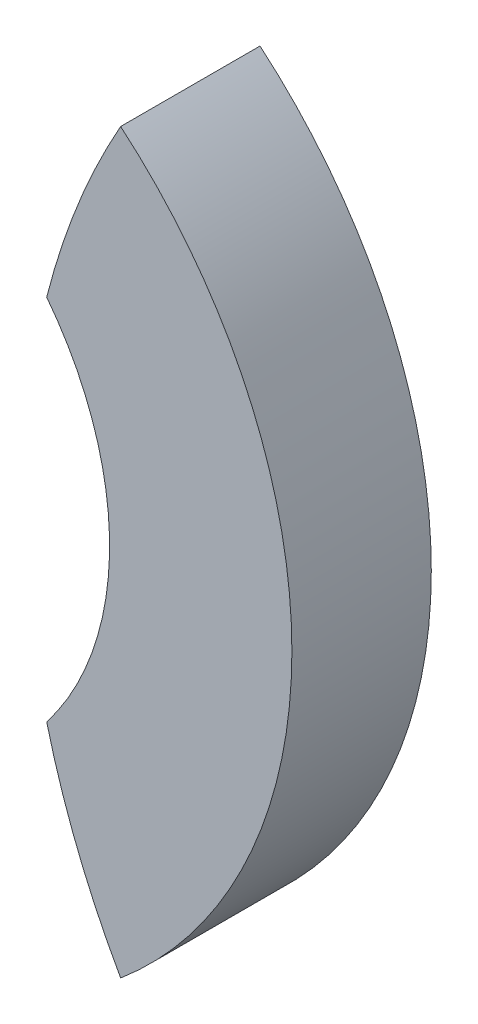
ISO-10303-21;
HEADER;
FILE_DESCRIPTION(('STEP AP214'),'2;1');
FILE_NAME('part.step','',(''),(''),'','','');
FILE_SCHEMA(('AUTOMOTIVE_DESIGN { 1 0 10303 214 1 1 1 1 }'));
ENDSEC;
DATA;
#1=APPLICATION_CONTEXT('core data for automotive mechanical design processes');
#2=APPLICATION_PROTOCOL_DEFINITION('international standard','automotive_design',2000,#1);
#3=PRODUCT_CONTEXT('',#1,'mechanical');
#4=PRODUCT('Part','Part','',(#3));
#5=PRODUCT_RELATED_PRODUCT_CATEGORY('part','',(#4));
#6=PRODUCT_DEFINITION_FORMATION('','',#4);
#7=PRODUCT_DEFINITION_CONTEXT('part definition',#1,'design');
#8=PRODUCT_DEFINITION('design','',#6,#7);
#9=PRODUCT_DEFINITION_SHAPE('','',#8);
#10=(LENGTH_UNIT() NAMED_UNIT(*) SI_UNIT(.MILLI.,.METRE.));
#11=(NAMED_UNIT(*) PLANE_ANGLE_UNIT() SI_UNIT($,.RADIAN.));
#12=(NAMED_UNIT(*) SI_UNIT($,.STERADIAN.) SOLID_ANGLE_UNIT());
#13=UNCERTAINTY_MEASURE_WITH_UNIT(LENGTH_MEASURE(1.E-05),#10,'distance_accuracy_value','');
#14=(GEOMETRIC_REPRESENTATION_CONTEXT(3) GLOBAL_UNCERTAINTY_ASSIGNED_CONTEXT((#13)) GLOBAL_UNIT_ASSIGNED_CONTEXT((#10,
#11,#12)) REPRESENTATION_CONTEXT('',''));
#15=CARTESIAN_POINT('',(0.,0.,0.));
#16=DIRECTION('',(0.,0.,1.));
#17=DIRECTION('',(1.,0.,0.));
#18=AXIS2_PLACEMENT_3D('',#15,#16,#17);
#19=CARTESIAN_POINT('',(45.,0.,6.5));
#20=DIRECTION('',(0.,0.,-1.));
#21=DIRECTION('',(-1.,0.,0.));
#22=AXIS2_PLACEMENT_3D('',#19,#20,#21);
#23=CYLINDRICAL_SURFACE('',#22,35.);
#24=CARTESIAN_POINT('',(45.,0.,0.));
#25=DIRECTION('',(0.,0.,1.));
#26=DIRECTION('',(1.,0.,0.));
#27=AXIS2_PLACEMENT_3D('',#24,#25,#26);
#28=CIRCLE('',#27,35.);
#29=CARTESIAN_POINT('',(14.5138888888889,17.192935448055,0.));
#30=VERTEX_POINT('',#29);
#31=CARTESIAN_POINT('',(11.0666666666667,8.57489876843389,0.));
#32=VERTEX_POINT('',#31);
#33=EDGE_CURVE('E97',#30,#32,#28,.T.);
#34=ORIENTED_EDGE('',*,*,#33,.T.);
#35=DIRECTION('',(0.,0.,-1.));
#36=VECTOR('',#35,1.);
#37=CARTESIAN_POINT('',(11.0666666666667,8.57489876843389,6.5));
#38=LINE('',#37,#36);
#39=CARTESIAN_POINT('',(11.0666666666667,8.57489876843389,6.5));
#40=VERTEX_POINT('',#39);
#41=EDGE_CURVE('E11',#40,#32,#38,.T.);
#42=ORIENTED_EDGE('',*,*,#41,.F.);
#43=CARTESIAN_POINT('',(45.,0.,6.5));
#44=DIRECTION('',(0.,0.,1.));
#45=DIRECTION('',(1.,0.,0.));
#46=AXIS2_PLACEMENT_3D('',#43,#44,#45);
#47=CIRCLE('',#46,35.);
#48=CARTESIAN_POINT('',(14.5138888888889,17.192935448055,6.5));
#49=VERTEX_POINT('',#48);
#50=EDGE_CURVE('E85',#49,#40,#47,.T.);
#51=ORIENTED_EDGE('',*,*,#50,.F.);
#52=DIRECTION('',(0.,0.,-1.));
#53=VECTOR('',#52,1.);
#54=CARTESIAN_POINT('',(14.5138888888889,17.192935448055,6.5));
#55=LINE('',#54,#53);
#56=EDGE_CURVE('E93',#49,#30,#55,.T.);
#57=ORIENTED_EDGE('',*,*,#56,.T.);
#58=EDGE_LOOP('',(#34,#42,#51,#57));
#59=FACE_BOUND('',#58,.T.);
#60=ADVANCED_FACE('F34',(#59),#23,.T.);
#61=CARTESIAN_POINT('',(0.,0.,6.5));
#62=DIRECTION('',(0.,0.,-1.));
#63=DIRECTION('',(-1.,0.,0.));
#64=AXIS2_PLACEMENT_3D('',#61,#62,#63);
#65=CYLINDRICAL_SURFACE('',#64,14.);
#66=CARTESIAN_POINT('',(0.,0.,0.));
#67=DIRECTION('',(0.,0.,-1.));
#68=DIRECTION('',(1.,0.,0.));
#69=AXIS2_PLACEMENT_3D('',#66,#67,#68);
#70=CIRCLE('',#69,14.);
#71=CARTESIAN_POINT('',(11.0666666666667,-8.57489876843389,0.));
#72=VERTEX_POINT('',#71);
#73=EDGE_CURVE('E89',#32,#72,#70,.T.);
#74=ORIENTED_EDGE('',*,*,#73,.T.);
#75=DIRECTION('',(0.,0.,-1.));
#76=VECTOR('',#75,1.);
#77=CARTESIAN_POINT('',(11.0666666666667,-8.57489876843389,6.5));
#78=LINE('',#77,#76);
#79=CARTESIAN_POINT('',(11.0666666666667,-8.57489876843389,6.5));
#80=VERTEX_POINT('',#79);
#81=EDGE_CURVE('E42',#80,#72,#78,.T.);
#82=ORIENTED_EDGE('',*,*,#81,.F.);
#83=CARTESIAN_POINT('',(0.,0.,6.5));
#84=DIRECTION('',(0.,0.,-1.));
#85=DIRECTION('',(1.,0.,0.));
#86=AXIS2_PLACEMENT_3D('',#83,#84,#85);
#87=CIRCLE('',#86,14.);
#88=EDGE_CURVE('E80',#40,#80,#87,.T.);
#89=ORIENTED_EDGE('',*,*,#88,.F.);
#90=ORIENTED_EDGE('',*,*,#41,.T.);
#91=EDGE_LOOP('',(#74,#82,#89,#90));
#92=FACE_BOUND('',#91,.T.);
#93=ADVANCED_FACE('F88',(#92),#65,.F.);
#94=CARTESIAN_POINT('',(45.,0.,6.5));
#95=DIRECTION('',(0.,0.,-1.));
#96=DIRECTION('',(-1.,0.,0.));
#97=AXIS2_PLACEMENT_3D('',#94,#95,#96);
#98=CYLINDRICAL_SURFACE('',#97,35.);
#99=CARTESIAN_POINT('',(45.,0.,0.));
#100=DIRECTION('',(0.,0.,1.));
#101=DIRECTION('',(1.,0.,0.));
#102=AXIS2_PLACEMENT_3D('',#99,#100,#101);
#103=CIRCLE('',#102,35.);
#104=CARTESIAN_POINT('',(14.5138888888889,-17.192935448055,0.));
#105=VERTEX_POINT('',#104);
#106=EDGE_CURVE('E67',#72,#105,#103,.T.);
#107=ORIENTED_EDGE('',*,*,#106,.T.);
#108=DIRECTION('',(0.,0.,-1.));
#109=VECTOR('',#108,1.);
#110=CARTESIAN_POINT('',(14.5138888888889,-17.192935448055,6.5));
#111=LINE('',#110,#109);
#112=CARTESIAN_POINT('',(14.5138888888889,-17.192935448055,6.5));
#113=VERTEX_POINT('',#112);
#114=EDGE_CURVE('E90',#113,#105,#111,.T.);
#115=ORIENTED_EDGE('',*,*,#114,.F.);
#116=CARTESIAN_POINT('',(45.,0.,6.5));
#117=DIRECTION('',(0.,0.,1.));
#118=DIRECTION('',(1.,0.,0.));
#119=AXIS2_PLACEMENT_3D('',#116,#117,#118);
#120=CIRCLE('',#119,35.);
#121=EDGE_CURVE('E83',#80,#113,#120,.T.);
#122=ORIENTED_EDGE('',*,*,#121,.F.);
#123=ORIENTED_EDGE('',*,*,#81,.T.);
#124=EDGE_LOOP('',(#107,#115,#122,#123));
#125=FACE_BOUND('',#124,.T.);
#126=ADVANCED_FACE('F91',(#125),#98,.T.);
#127=CARTESIAN_POINT('',(0.,0.,6.5));
#128=DIRECTION('',(0.,0.,-1.));
#129=DIRECTION('',(-1.,0.,0.));
#130=AXIS2_PLACEMENT_3D('',#127,#128,#129);
#131=CYLINDRICAL_SURFACE('',#130,22.5);
#132=CARTESIAN_POINT('',(0.,0.,0.));
#133=DIRECTION('',(0.,0.,1.));
#134=DIRECTION('',(1.,0.,0.));
#135=AXIS2_PLACEMENT_3D('',#132,#133,#134);
#136=CIRCLE('',#135,22.5);
#137=EDGE_CURVE('E73',#105,#30,#136,.T.);
#138=ORIENTED_EDGE('',*,*,#137,.T.);
#139=ORIENTED_EDGE('',*,*,#56,.F.);
#140=CARTESIAN_POINT('',(0.,0.,6.5));
#141=DIRECTION('',(0.,0.,1.));
#142=DIRECTION('',(1.,0.,0.));
#143=AXIS2_PLACEMENT_3D('',#140,#141,#142);
#144=CIRCLE('',#143,22.5);
#145=EDGE_CURVE('E50',#113,#49,#144,.T.);
#146=ORIENTED_EDGE('',*,*,#145,.F.);
#147=ORIENTED_EDGE('',*,*,#114,.T.);
#148=EDGE_LOOP('',(#138,#139,#146,#147));
#149=FACE_BOUND('',#148,.T.);
#150=ADVANCED_FACE('F104',(#149),#131,.T.);
#151=CARTESIAN_POINT('',(22.5,0.,6.5));
#152=DIRECTION('',(0.,0.,1.));
#153=DIRECTION('',(1.,0.,0.));
#154=AXIS2_PLACEMENT_3D('',#151,#152,#153);
#155=PLANE('',#154);
#156=ORIENTED_EDGE('',*,*,#50,.T.);
#157=ORIENTED_EDGE('',*,*,#88,.T.);
#158=ORIENTED_EDGE('',*,*,#121,.T.);
#159=ORIENTED_EDGE('',*,*,#145,.T.);
#160=EDGE_LOOP('',(#156,#157,#158,#159));
#161=FACE_BOUND('',#160,.T.);
#162=ADVANCED_FACE('F81',(#161),#155,.T.);
#163=CARTESIAN_POINT('',(22.5,0.,0.));
#164=DIRECTION('',(0.,0.,1.));
#165=DIRECTION('',(1.,0.,0.));
#166=AXIS2_PLACEMENT_3D('',#163,#164,#165);
#167=PLANE('',#166);
#168=ORIENTED_EDGE('',*,*,#33,.F.);
#169=ORIENTED_EDGE('',*,*,#137,.F.);
#170=ORIENTED_EDGE('',*,*,#106,.F.);
#171=ORIENTED_EDGE('',*,*,#73,.F.);
#172=EDGE_LOOP('',(#168,#169,#170,#171));
#173=FACE_BOUND('',#172,.T.);
#174=ADVANCED_FACE('F107',(#173),#167,.F.);
#175=CLOSED_SHELL('',(#60,#93,#126,#150,#162,#174));
#176=MANIFOLD_SOLID_BREP('B2',#175);
#177=ADVANCED_BREP_SHAPE_REPRESENTATION('',(#18,#176),#14);
#178=SHAPE_DEFINITION_REPRESENTATION(#9,#177);
ENDSEC;
END-ISO-10303-21;
